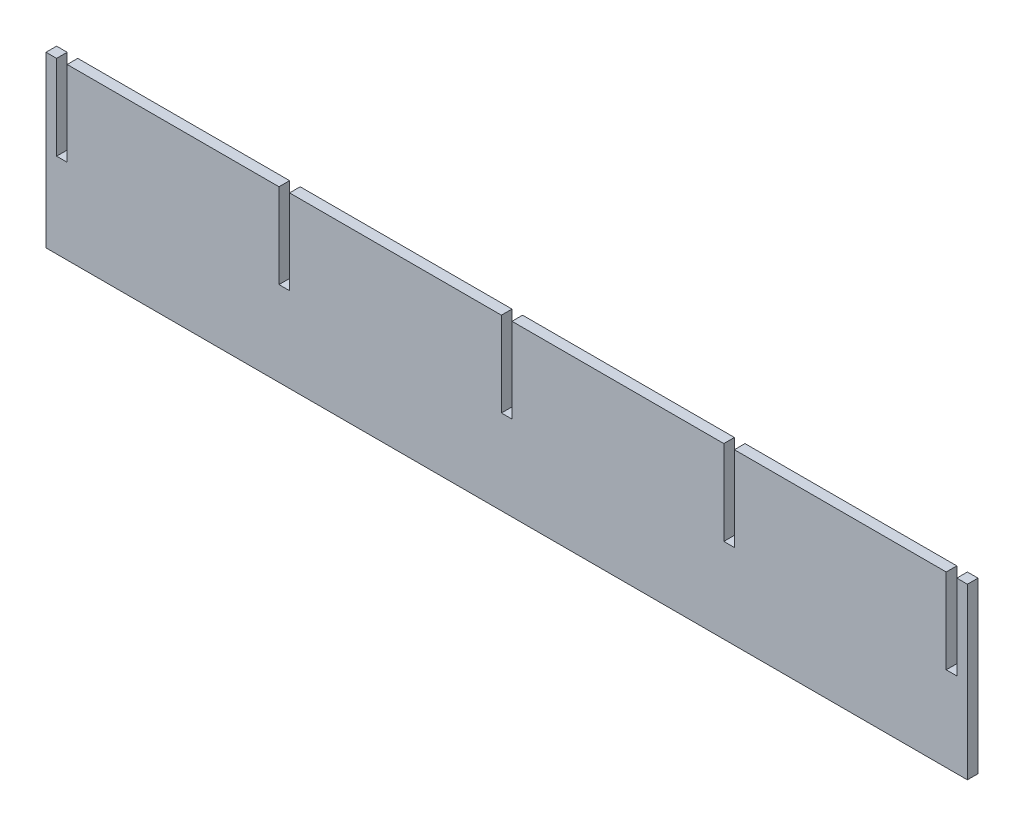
from build123d import *

# Parameters (mm, degrees)
BOSS_EXTRUDE1_DEPTH = 6.35


with BuildPart() as part:
    # Sketch1 → Boss-Extrude1 (new body)
    with BuildSketch(Plane.XY):
        Polygon((431.8, 0), (431.8, 101.6), (438.15, 101.6), (438.15, 50.8), (444.5, 50.8), (444.5, 101.6), (571.5, 101.6), (571.5, 50.8), (577.85, 50.8), (577.85, 101.6), (704.85, 101.6), (704.85, 50.8), (711.2, 50.8), (711.2, 101.6), (838.2, 101.6), (838.2, 50.8), (844.55, 50.8), (844.55, 101.6), (971.55, 101.6), (971.55, 50.8), (977.9, 50.8), (977.9, 101.6), (984.25, 101.6), (984.25, 0), align=None)
    extrude(amount=BOSS_EXTRUDE1_DEPTH)


solid = part.part
